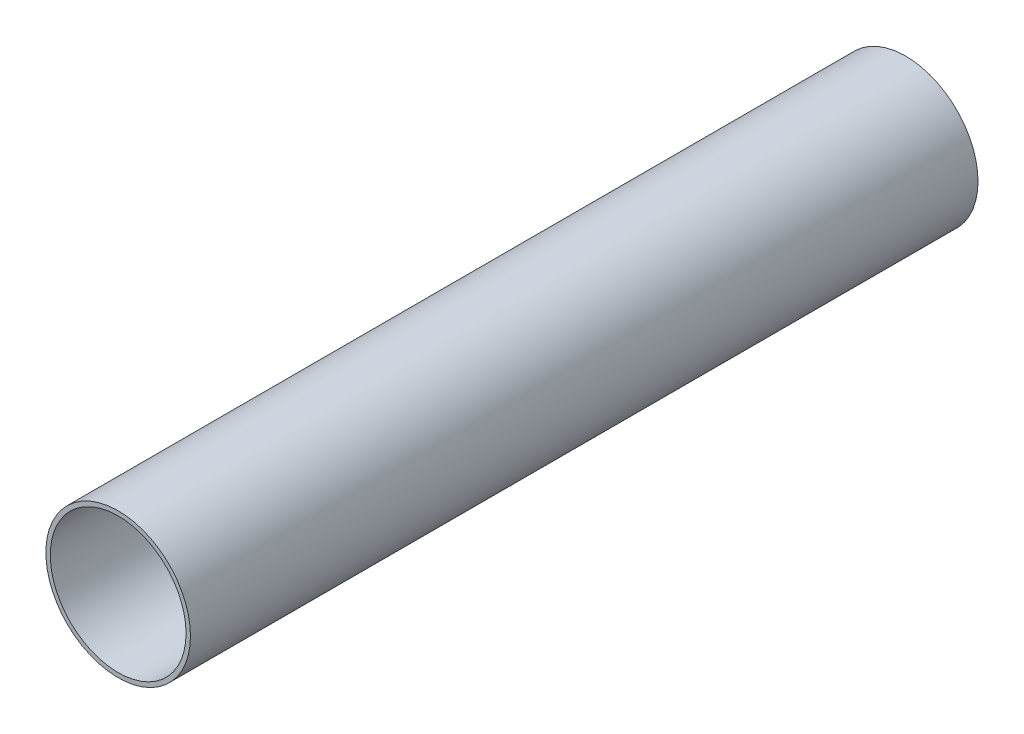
ISO-10303-21;
HEADER;
FILE_DESCRIPTION(('STEP AP214'),'2;1');
FILE_NAME('part.step','',(''),(''),'','','');
FILE_SCHEMA(('AUTOMOTIVE_DESIGN { 1 0 10303 214 1 1 1 1 }'));
ENDSEC;
DATA;
#1=APPLICATION_CONTEXT('core data for automotive mechanical design processes');
#2=APPLICATION_PROTOCOL_DEFINITION('international standard','automotive_design',2000,#1);
#3=PRODUCT_CONTEXT('',#1,'mechanical');
#4=PRODUCT('Part','Part','',(#3));
#5=PRODUCT_RELATED_PRODUCT_CATEGORY('part','',(#4));
#6=PRODUCT_DEFINITION_FORMATION('','',#4);
#7=PRODUCT_DEFINITION_CONTEXT('part definition',#1,'design');
#8=PRODUCT_DEFINITION('design','',#6,#7);
#9=PRODUCT_DEFINITION_SHAPE('','',#8);
#10=(LENGTH_UNIT() NAMED_UNIT(*) SI_UNIT(.MILLI.,.METRE.));
#11=(NAMED_UNIT(*) PLANE_ANGLE_UNIT() SI_UNIT($,.RADIAN.));
#12=(NAMED_UNIT(*) SI_UNIT($,.STERADIAN.) SOLID_ANGLE_UNIT());
#13=UNCERTAINTY_MEASURE_WITH_UNIT(LENGTH_MEASURE(1.E-05),#10,'distance_accuracy_value','');
#14=(GEOMETRIC_REPRESENTATION_CONTEXT(3) GLOBAL_UNCERTAINTY_ASSIGNED_CONTEXT((#13)) GLOBAL_UNIT_ASSIGNED_CONTEXT((#10,
#11,#12)) REPRESENTATION_CONTEXT('',''));
#15=CARTESIAN_POINT('',(0.,0.,0.));
#16=DIRECTION('',(0.,0.,1.));
#17=DIRECTION('',(1.,0.,0.));
#18=AXIS2_PLACEMENT_3D('',#15,#16,#17);
#19=CARTESIAN_POINT('',(0.,0.,294.64));
#20=DIRECTION('',(0.,0.,1.));
#21=DIRECTION('',(1.,0.,0.));
#22=AXIS2_PLACEMENT_3D('',#19,#20,#21);
#23=PLANE('',#22);
#24=CARTESIAN_POINT('',(0.,0.,294.64));
#25=DIRECTION('',(0.,0.,1.));
#26=DIRECTION('',(1.,0.,0.));
#27=AXIS2_PLACEMENT_3D('',#24,#25,#26);
#28=CIRCLE('',#27,27.051);
#29=CARTESIAN_POINT('',(27.051,0.,294.64));
#30=VERTEX_POINT('',#29);
#31=EDGE_CURVE('E10',#30,#30,#28,.T.);
#32=ORIENTED_EDGE('',*,*,#31,.T.);
#33=EDGE_LOOP('',(#32));
#34=FACE_BOUND('',#33,.T.);
#35=CARTESIAN_POINT('',(0.,0.,294.64));
#36=DIRECTION('',(0.,0.,1.));
#37=DIRECTION('',(1.,0.,0.));
#38=AXIS2_PLACEMENT_3D('',#35,#36,#37);
#39=CIRCLE('',#38,25.4);
#40=CARTESIAN_POINT('',(25.4,0.,294.64));
#41=VERTEX_POINT('',#40);
#42=EDGE_CURVE('E39',#41,#41,#39,.T.);
#43=ORIENTED_EDGE('',*,*,#42,.F.);
#44=EDGE_LOOP('',(#43));
#45=FACE_BOUND('',#44,.T.);
#46=ADVANCED_FACE('F28',(#34,#45),#23,.T.);
#47=CARTESIAN_POINT('',(0.,0.,0.));
#48=DIRECTION('',(0.,0.,1.));
#49=DIRECTION('',(1.,0.,0.));
#50=AXIS2_PLACEMENT_3D('',#47,#48,#49);
#51=PLANE('',#50);
#52=CARTESIAN_POINT('',(0.,0.,0.));
#53=DIRECTION('',(0.,0.,1.));
#54=DIRECTION('',(1.,0.,0.));
#55=AXIS2_PLACEMENT_3D('',#52,#53,#54);
#56=CIRCLE('',#55,27.051);
#57=CARTESIAN_POINT('',(27.051,0.,0.));
#58=VERTEX_POINT('',#57);
#59=EDGE_CURVE('E35',#58,#58,#56,.T.);
#60=ORIENTED_EDGE('',*,*,#59,.F.);
#61=EDGE_LOOP('',(#60));
#62=FACE_BOUND('',#61,.T.);
#63=CARTESIAN_POINT('',(0.,0.,0.));
#64=DIRECTION('',(0.,0.,1.));
#65=DIRECTION('',(1.,0.,0.));
#66=AXIS2_PLACEMENT_3D('',#63,#64,#65);
#67=CIRCLE('',#66,25.4);
#68=CARTESIAN_POINT('',(25.4,0.,0.));
#69=VERTEX_POINT('',#68);
#70=EDGE_CURVE('E43',#69,#69,#67,.T.);
#71=ORIENTED_EDGE('',*,*,#70,.T.);
#72=EDGE_LOOP('',(#71));
#73=FACE_BOUND('',#72,.T.);
#74=ADVANCED_FACE('F49',(#62,#73),#51,.F.);
#75=CARTESIAN_POINT('',(0.,0.,294.64));
#76=DIRECTION('',(0.,0.,-1.));
#77=DIRECTION('',(-1.,0.,0.));
#78=AXIS2_PLACEMENT_3D('',#75,#76,#77);
#79=CYLINDRICAL_SURFACE('',#78,27.051);
#80=ORIENTED_EDGE('',*,*,#31,.F.);
#81=EDGE_LOOP('',(#80));
#82=FACE_BOUND('',#81,.T.);
#83=ORIENTED_EDGE('',*,*,#59,.T.);
#84=EDGE_LOOP('',(#83));
#85=FACE_BOUND('',#84,.T.);
#86=ADVANCED_FACE('F30',(#82,#85),#79,.T.);
#87=CARTESIAN_POINT('',(0.,0.,294.64));
#88=DIRECTION('',(0.,0.,-1.));
#89=DIRECTION('',(-1.,0.,0.));
#90=AXIS2_PLACEMENT_3D('',#87,#88,#89);
#91=CYLINDRICAL_SURFACE('',#90,25.4);
#92=ORIENTED_EDGE('',*,*,#42,.T.);
#93=EDGE_LOOP('',(#92));
#94=FACE_BOUND('',#93,.T.);
#95=ORIENTED_EDGE('',*,*,#70,.F.);
#96=EDGE_LOOP('',(#95));
#97=FACE_BOUND('',#96,.T.);
#98=ADVANCED_FACE('F51',(#94,#97),#91,.F.);
#99=CLOSED_SHELL('',(#46,#74,#86,#98));
#100=MANIFOLD_SOLID_BREP('B2',#99);
#101=ADVANCED_BREP_SHAPE_REPRESENTATION('',(#18,#100),#14);
#102=SHAPE_DEFINITION_REPRESENTATION(#9,#101);
ENDSEC;
END-ISO-10303-21;
